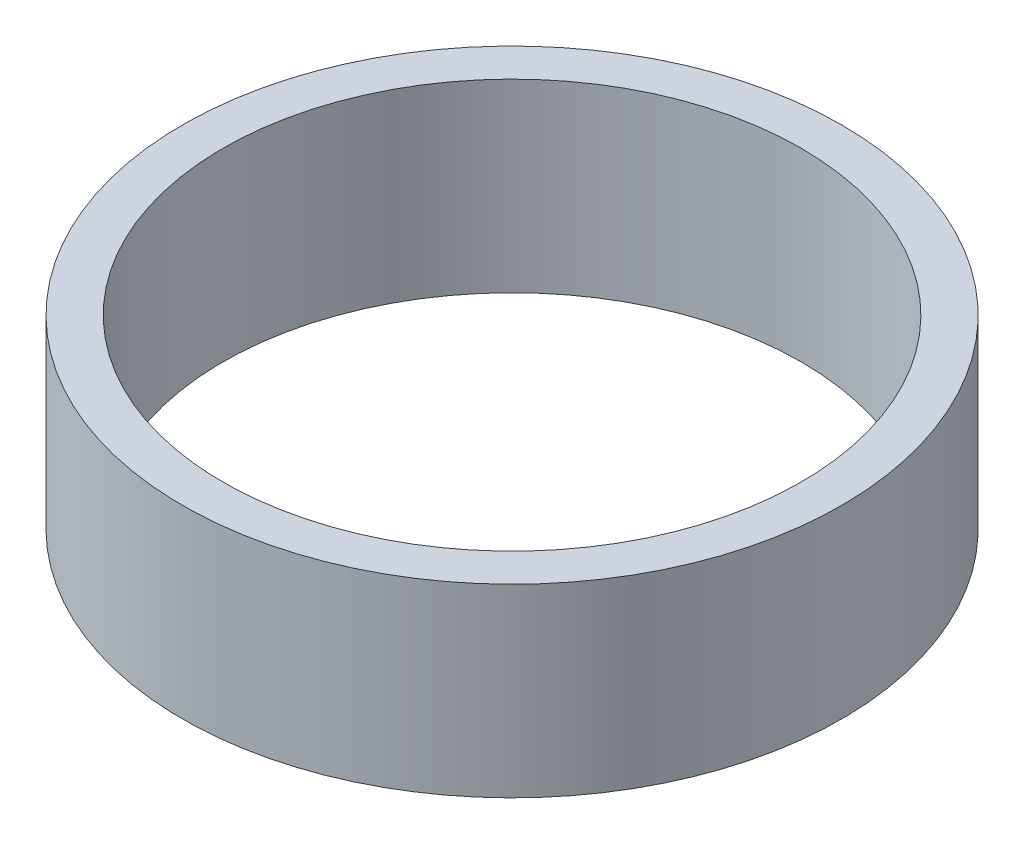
ISO-10303-21;
HEADER;
FILE_DESCRIPTION(('STEP AP214'),'2;1');
FILE_NAME('part.step','',(''),(''),'','','');
FILE_SCHEMA(('AUTOMOTIVE_DESIGN { 1 0 10303 214 1 1 1 1 }'));
ENDSEC;
DATA;
#1=APPLICATION_CONTEXT('core data for automotive mechanical design processes');
#2=APPLICATION_PROTOCOL_DEFINITION('international standard','automotive_design',2000,#1);
#3=PRODUCT_CONTEXT('',#1,'mechanical');
#4=PRODUCT('Part','Part','',(#3));
#5=PRODUCT_RELATED_PRODUCT_CATEGORY('part','',(#4));
#6=PRODUCT_DEFINITION_FORMATION('','',#4);
#7=PRODUCT_DEFINITION_CONTEXT('part definition',#1,'design');
#8=PRODUCT_DEFINITION('design','',#6,#7);
#9=PRODUCT_DEFINITION_SHAPE('','',#8);
#10=(LENGTH_UNIT() NAMED_UNIT(*) SI_UNIT(.MILLI.,.METRE.));
#11=(NAMED_UNIT(*) PLANE_ANGLE_UNIT() SI_UNIT($,.RADIAN.));
#12=(NAMED_UNIT(*) SI_UNIT($,.STERADIAN.) SOLID_ANGLE_UNIT());
#13=UNCERTAINTY_MEASURE_WITH_UNIT(LENGTH_MEASURE(1.E-05),#10,'distance_accuracy_value','');
#14=(GEOMETRIC_REPRESENTATION_CONTEXT(3) GLOBAL_UNCERTAINTY_ASSIGNED_CONTEXT((#13)) GLOBAL_UNIT_ASSIGNED_CONTEXT((#10,
#11,#12)) REPRESENTATION_CONTEXT('',''));
#15=CARTESIAN_POINT('',(0.,0.,0.));
#16=DIRECTION('',(0.,0.,1.));
#17=DIRECTION('',(1.,0.,0.));
#18=AXIS2_PLACEMENT_3D('',#15,#16,#17);
#19=CARTESIAN_POINT('',(0.,0.,0.));
#20=DIRECTION('',(0.,-1.,0.));
#21=DIRECTION('',(0.,0.,-1.));
#22=AXIS2_PLACEMENT_3D('',#19,#20,#21);
#23=CYLINDRICAL_SURFACE('',#22,12.5);
#24=CARTESIAN_POINT('',(0.,0.,0.));
#25=DIRECTION('',(0.,-1.,0.));
#26=DIRECTION('',(0.,0.,-1.));
#27=AXIS2_PLACEMENT_3D('',#24,#25,#26);
#28=CIRCLE('',#27,12.5);
#29=CARTESIAN_POINT('',(0.,0.,-12.5));
#30=VERTEX_POINT('',#29);
#31=EDGE_CURVE('E54',#30,#30,#28,.T.);
#32=ORIENTED_EDGE('',*,*,#31,.T.);
#33=EDGE_LOOP('',(#32));
#34=FACE_BOUND('',#33,.T.);
#35=CARTESIAN_POINT('',(0.,8.00000000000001,1.66533453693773E-13));
#36=DIRECTION('',(0.,-1.,0.));
#37=DIRECTION('',(0.,0.,-1.));
#38=AXIS2_PLACEMENT_3D('',#35,#36,#37);
#39=CIRCLE('',#38,12.5);
#40=CARTESIAN_POINT('',(0.,8.00000000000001,-12.4999999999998));
#41=VERTEX_POINT('',#40);
#42=EDGE_CURVE('E10',#41,#41,#39,.T.);
#43=ORIENTED_EDGE('',*,*,#42,.F.);
#44=EDGE_LOOP('',(#43));
#45=FACE_BOUND('',#44,.T.);
#46=ADVANCED_FACE('F40',(#34,#45),#23,.F.);
#47=CARTESIAN_POINT('',(12.5,7.99999999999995,0.));
#48=DIRECTION('',(0.,1.,0.));
#49=DIRECTION('',(0.,0.,1.));
#50=AXIS2_PLACEMENT_3D('',#47,#48,#49);
#51=PLANE('',#50);
#52=ORIENTED_EDGE('',*,*,#42,.T.);
#53=EDGE_LOOP('',(#52));
#54=FACE_BOUND('',#53,.T.);
#55=CARTESIAN_POINT('',(0.,8.00000000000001,1.66533453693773E-13));
#56=DIRECTION('',(0.,-1.,0.));
#57=DIRECTION('',(0.,0.,-1.));
#58=AXIS2_PLACEMENT_3D('',#55,#56,#57);
#59=CIRCLE('',#58,14.25);
#60=CARTESIAN_POINT('',(0.,8.00000000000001,-14.2499999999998));
#61=VERTEX_POINT('',#60);
#62=EDGE_CURVE('E46',#61,#61,#59,.T.);
#63=ORIENTED_EDGE('',*,*,#62,.F.);
#64=EDGE_LOOP('',(#63));
#65=FACE_BOUND('',#64,.T.);
#66=ADVANCED_FACE('F70',(#54,#65),#51,.T.);
#67=CARTESIAN_POINT('',(0.,0.,0.));
#68=DIRECTION('',(0.,-1.,0.));
#69=DIRECTION('',(0.,0.,-1.));
#70=AXIS2_PLACEMENT_3D('',#67,#68,#69);
#71=CYLINDRICAL_SURFACE('',#70,14.25);
#72=ORIENTED_EDGE('',*,*,#62,.T.);
#73=EDGE_LOOP('',(#72));
#74=FACE_BOUND('',#73,.T.);
#75=CARTESIAN_POINT('',(0.,0.,0.));
#76=DIRECTION('',(0.,-1.,0.));
#77=DIRECTION('',(0.,0.,-1.));
#78=AXIS2_PLACEMENT_3D('',#75,#76,#77);
#79=CIRCLE('',#78,14.25);
#80=CARTESIAN_POINT('',(0.,0.,-14.25));
#81=VERTEX_POINT('',#80);
#82=EDGE_CURVE('E50',#81,#81,#79,.T.);
#83=ORIENTED_EDGE('',*,*,#82,.F.);
#84=EDGE_LOOP('',(#83));
#85=FACE_BOUND('',#84,.T.);
#86=ADVANCED_FACE('F64',(#74,#85),#71,.T.);
#87=CARTESIAN_POINT('',(12.5000000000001,0.,1.38777878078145E-13));
#88=DIRECTION('',(0.,-1.,0.));
#89=DIRECTION('',(0.,0.,-1.));
#90=AXIS2_PLACEMENT_3D('',#87,#88,#89);
#91=PLANE('',#90);
#92=ORIENTED_EDGE('',*,*,#82,.T.);
#93=EDGE_LOOP('',(#92));
#94=FACE_BOUND('',#93,.T.);
#95=ORIENTED_EDGE('',*,*,#31,.F.);
#96=EDGE_LOOP('',(#95));
#97=FACE_BOUND('',#96,.T.);
#98=ADVANCED_FACE('F62',(#94,#97),#91,.T.);
#99=CLOSED_SHELL('',(#46,#66,#86,#98));
#100=MANIFOLD_SOLID_BREP('B2',#99);
#101=ADVANCED_BREP_SHAPE_REPRESENTATION('',(#18,#100),#14);
#102=SHAPE_DEFINITION_REPRESENTATION(#9,#101);
ENDSEC;
END-ISO-10303-21;
